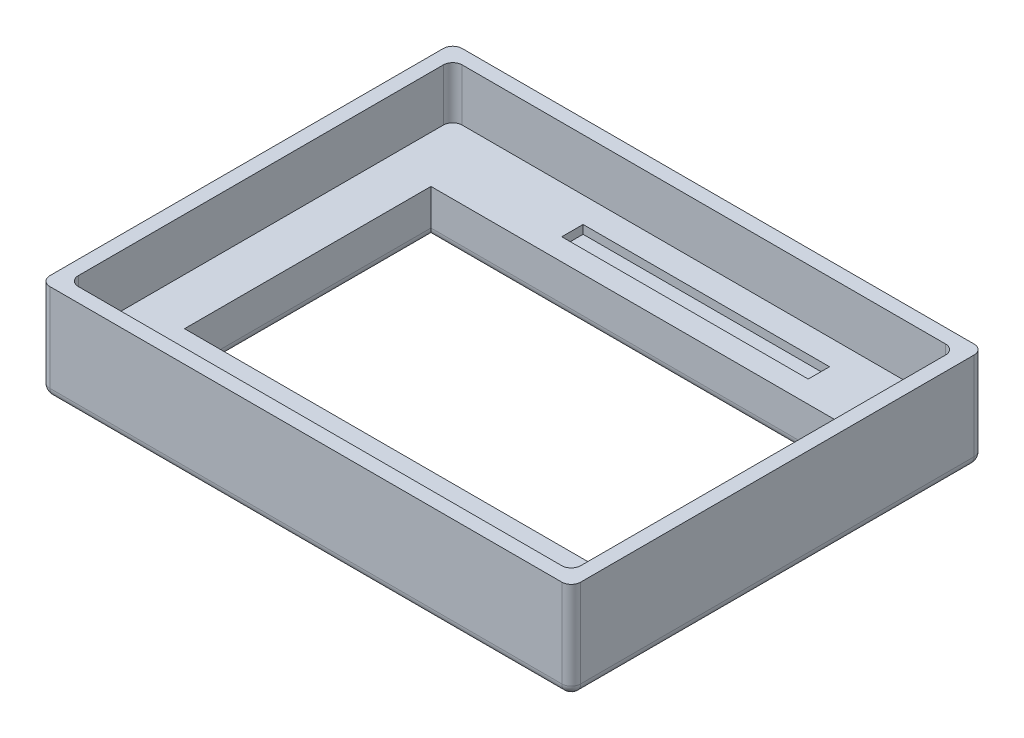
ISO-10303-21;
HEADER;
FILE_DESCRIPTION(('STEP AP214'),'2;1');
FILE_NAME('part.step','',(''),(''),'','','');
FILE_SCHEMA(('AUTOMOTIVE_DESIGN { 1 0 10303 214 1 1 1 1 }'));
ENDSEC;
DATA;
#1=APPLICATION_CONTEXT('core data for automotive mechanical design processes');
#2=APPLICATION_PROTOCOL_DEFINITION('international standard','automotive_design',2000,#1);
#3=PRODUCT_CONTEXT('',#1,'mechanical');
#4=PRODUCT('Part','Part','',(#3));
#5=PRODUCT_RELATED_PRODUCT_CATEGORY('part','',(#4));
#6=PRODUCT_DEFINITION_FORMATION('','',#4);
#7=PRODUCT_DEFINITION_CONTEXT('part definition',#1,'design');
#8=PRODUCT_DEFINITION('design','',#6,#7);
#9=PRODUCT_DEFINITION_SHAPE('','',#8);
#10=(LENGTH_UNIT() NAMED_UNIT(*) SI_UNIT(.MILLI.,.METRE.));
#11=(NAMED_UNIT(*) PLANE_ANGLE_UNIT() SI_UNIT($,.RADIAN.));
#12=(NAMED_UNIT(*) SI_UNIT($,.STERADIAN.) SOLID_ANGLE_UNIT());
#13=UNCERTAINTY_MEASURE_WITH_UNIT(LENGTH_MEASURE(1.E-05),#10,'distance_accuracy_value','');
#14=(GEOMETRIC_REPRESENTATION_CONTEXT(3) GLOBAL_UNCERTAINTY_ASSIGNED_CONTEXT((#13)) GLOBAL_UNIT_ASSIGNED_CONTEXT((#10,
#11,#12)) REPRESENTATION_CONTEXT('',''));
#15=CARTESIAN_POINT('',(0.,0.,0.));
#16=DIRECTION('',(0.,0.,1.));
#17=DIRECTION('',(1.,0.,0.));
#18=AXIS2_PLACEMENT_3D('',#15,#16,#17);
#19=CARTESIAN_POINT('',(0.,9.6,0.));
#20=DIRECTION('',(0.,1.,0.));
#21=DIRECTION('',(0.,0.,1.));
#22=AXIS2_PLACEMENT_3D('',#19,#20,#21);
#23=PLANE('',#22);
#24=DIRECTION('',(0.,0.,1.));
#25=VECTOR('',#24,1.);
#26=CARTESIAN_POINT('',(-14.3182788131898,9.6,-19.3381124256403));
#27=LINE('',#26,#25);
#28=CARTESIAN_POINT('',(-14.3182788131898,9.6,-19.3381124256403));
#29=VERTEX_POINT('',#28);
#30=CARTESIAN_POINT('',(-14.3182788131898,9.6,-14.8381124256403));
#31=VERTEX_POINT('',#30);
#32=EDGE_CURVE('E224',#29,#31,#27,.T.);
#33=ORIENTED_EDGE('',*,*,#32,.F.);
#34=DIRECTION('',(-1.,0.,0.));
#35=VECTOR('',#34,1.);
#36=CARTESIAN_POINT('',(-14.3182788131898,9.6,-19.3381124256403));
#37=LINE('',#36,#35);
#38=CARTESIAN_POINT('',(37.6817211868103,9.6,-19.3381124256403));
#39=VERTEX_POINT('',#38);
#40=EDGE_CURVE('E241',#39,#29,#37,.T.);
#41=ORIENTED_EDGE('',*,*,#40,.F.);
#42=DIRECTION('',(0.,0.,-1.));
#43=VECTOR('',#42,1.);
#44=CARTESIAN_POINT('',(37.6817211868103,9.6,-19.3381124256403));
#45=LINE('',#44,#43);
#46=CARTESIAN_POINT('',(37.6817211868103,9.6,-14.8381124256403));
#47=VERTEX_POINT('',#46);
#48=EDGE_CURVE('E244',#47,#39,#45,.T.);
#49=ORIENTED_EDGE('',*,*,#48,.F.);
#50=DIRECTION('',(1.,0.,0.));
#51=VECTOR('',#50,1.);
#52=CARTESIAN_POINT('',(-14.3182788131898,9.6,-14.8381124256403));
#53=LINE('',#52,#51);
#54=EDGE_CURVE('E253',#31,#47,#53,.T.);
#55=ORIENTED_EDGE('',*,*,#54,.F.);
#56=EDGE_LOOP('',(#33,#41,#49,#55));
#57=FACE_BOUND('',#56,.T.);
#58=DIRECTION('',(0.,0.,1.));
#59=VECTOR('',#58,1.);
#60=CARTESIAN_POINT('',(-37.3182788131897,9.6,-10.2381124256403));
#61=LINE('',#60,#59);
#62=CARTESIAN_POINT('',(-37.3182788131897,9.6,-10.2381124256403));
#63=VERTEX_POINT('',#62);
#64=CARTESIAN_POINT('',(-37.3182788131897,9.6,41.7618875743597));
#65=VERTEX_POINT('',#64);
#66=EDGE_CURVE('E259',#63,#65,#61,.T.);
#67=ORIENTED_EDGE('',*,*,#66,.F.);
#68=DIRECTION('',(-1.,0.,0.));
#69=VECTOR('',#68,1.);
#70=CARTESIAN_POINT('',(-37.3182788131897,9.6,-10.2381124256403));
#71=LINE('',#70,#69);
#72=CARTESIAN_POINT('',(48.7817211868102,9.6,-10.2381124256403));
#73=VERTEX_POINT('',#72);
#74=EDGE_CURVE('E271',#73,#63,#71,.T.);
#75=ORIENTED_EDGE('',*,*,#74,.F.);
#76=DIRECTION('',(0.,0.,-1.));
#77=VECTOR('',#76,1.);
#78=CARTESIAN_POINT('',(48.7817211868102,9.6,-10.2381124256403));
#79=LINE('',#78,#77);
#80=CARTESIAN_POINT('',(48.7817211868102,9.6,41.7618875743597));
#81=VERTEX_POINT('',#80);
#82=EDGE_CURVE('E268',#81,#73,#79,.T.);
#83=ORIENTED_EDGE('',*,*,#82,.F.);
#84=DIRECTION('',(1.,0.,0.));
#85=VECTOR('',#84,1.);
#86=CARTESIAN_POINT('',(-37.3182788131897,9.6,41.7618875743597));
#87=LINE('',#86,#85);
#88=EDGE_CURVE('E265',#65,#81,#87,.T.);
#89=ORIENTED_EDGE('',*,*,#88,.F.);
#90=EDGE_LOOP('',(#67,#75,#83,#89));
#91=FACE_BOUND('',#90,.T.);
#92=DIRECTION('',(-1.,0.,0.));
#93=VECTOR('',#92,1.);
#94=CARTESIAN_POINT('',(-47.2182788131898,9.6,-24.7381124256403));
#95=LINE('',#94,#93);
#96=CARTESIAN_POINT('',(56.7817211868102,9.6,-24.7381124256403));
#97=VERTEX_POINT('',#96);
#98=CARTESIAN_POINT('',(-45.2182788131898,9.6,-24.7381124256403));
#99=VERTEX_POINT('',#98);
#100=EDGE_CURVE('E305',#97,#99,#95,.T.);
#101=ORIENTED_EDGE('',*,*,#100,.T.);
#102=CARTESIAN_POINT('',(-45.2182788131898,9.6,-22.7381124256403));
#103=DIRECTION('',(0.,1.,0.));
#104=DIRECTION('',(0.,0.,1.));
#105=AXIS2_PLACEMENT_3D('',#102,#103,#104);
#106=CIRCLE('',#105,2.);
#107=CARTESIAN_POINT('',(-47.2182788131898,9.6,-22.7381124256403));
#108=VERTEX_POINT('',#107);
#109=EDGE_CURVE('E598',#99,#108,#106,.T.);
#110=ORIENTED_EDGE('',*,*,#109,.T.);
#111=DIRECTION('',(0.,0.,1.));
#112=VECTOR('',#111,1.);
#113=CARTESIAN_POINT('',(-47.2182788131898,9.6,-24.7381124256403));
#114=LINE('',#113,#112);
#115=CARTESIAN_POINT('',(-47.2182788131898,9.6,54.2618875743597));
#116=VERTEX_POINT('',#115);
#117=EDGE_CURVE('E277',#108,#116,#114,.T.);
#118=ORIENTED_EDGE('',*,*,#117,.T.);
#119=CARTESIAN_POINT('',(-45.2182788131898,9.6,54.2618875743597));
#120=DIRECTION('',(0.,1.,0.));
#121=DIRECTION('',(0.,0.,1.));
#122=AXIS2_PLACEMENT_3D('',#119,#120,#121);
#123=CIRCLE('',#122,2.);
#124=CARTESIAN_POINT('',(-45.2182788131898,9.6,56.2618875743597));
#125=VERTEX_POINT('',#124);
#126=EDGE_CURVE('E320',#116,#125,#123,.T.);
#127=ORIENTED_EDGE('',*,*,#126,.T.);
#128=DIRECTION('',(1.,0.,0.));
#129=VECTOR('',#128,1.);
#130=CARTESIAN_POINT('',(-47.2182788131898,9.6,56.2618875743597));
#131=LINE('',#130,#129);
#132=CARTESIAN_POINT('',(56.7817211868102,9.6,56.2618875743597));
#133=VERTEX_POINT('',#132);
#134=EDGE_CURVE('E291',#125,#133,#131,.T.);
#135=ORIENTED_EDGE('',*,*,#134,.T.);
#136=CARTESIAN_POINT('',(56.7817211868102,9.6,54.2618875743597));
#137=DIRECTION('',(0.,1.,0.));
#138=DIRECTION('',(0.,0.,1.));
#139=AXIS2_PLACEMENT_3D('',#136,#137,#138);
#140=CIRCLE('',#139,2.);
#141=CARTESIAN_POINT('',(58.7817211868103,9.6,54.2618875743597));
#142=VERTEX_POINT('',#141);
#143=EDGE_CURVE('E606',#133,#142,#140,.T.);
#144=ORIENTED_EDGE('',*,*,#143,.T.);
#145=DIRECTION('',(0.,0.,-1.));
#146=VECTOR('',#145,1.);
#147=CARTESIAN_POINT('',(58.7817211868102,9.6,-24.7381124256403));
#148=LINE('',#147,#146);
#149=CARTESIAN_POINT('',(58.7817211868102,9.6,-22.7381124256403));
#150=VERTEX_POINT('',#149);
#151=EDGE_CURVE('E296',#142,#150,#148,.T.);
#152=ORIENTED_EDGE('',*,*,#151,.T.);
#153=CARTESIAN_POINT('',(56.7817211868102,9.6,-22.7381124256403));
#154=DIRECTION('',(0.,1.,0.));
#155=DIRECTION('',(0.,0.,1.));
#156=AXIS2_PLACEMENT_3D('',#153,#154,#155);
#157=CIRCLE('',#156,2.);
#158=EDGE_CURVE('E600',#150,#97,#157,.T.);
#159=ORIENTED_EDGE('',*,*,#158,.T.);
#160=EDGE_LOOP('',(#101,#110,#118,#127,#135,#144,#152,#159));
#161=FACE_BOUND('',#160,.T.);
#162=ADVANCED_FACE('F32',(#57,#91,#161),#23,.T.);
#163=CARTESIAN_POINT('',(0.,0.,0.));
#164=DIRECTION('',(0.,1.,0.));
#165=DIRECTION('',(0.,0.,1.));
#166=AXIS2_PLACEMENT_3D('',#163,#164,#165);
#167=PLANE('',#166);
#168=DIRECTION('',(0.,0.,1.));
#169=VECTOR('',#168,1.);
#170=CARTESIAN_POINT('',(-48.2182788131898,0.,0.));
#171=LINE('',#170,#169);
#172=CARTESIAN_POINT('',(-48.2182788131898,0.,57.2618875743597));
#173=VERTEX_POINT('',#172);
#174=CARTESIAN_POINT('',(-48.2182788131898,0.,-25.7381124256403));
#175=VERTEX_POINT('',#174);
#176=EDGE_CURVE('E472',#173,#175,#171,.F.);
#177=ORIENTED_EDGE('',*,*,#176,.T.);
#178=DIRECTION('',(1.,0.,0.));
#179=VECTOR('',#178,1.);
#180=CARTESIAN_POINT('',(61.7817211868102,0.,-25.7381124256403));
#181=LINE('',#180,#179);
#182=CARTESIAN_POINT('',(59.7817211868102,0.,-25.7381124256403));
#183=VERTEX_POINT('',#182);
#184=EDGE_CURVE('E474',#175,#183,#181,.T.);
#185=ORIENTED_EDGE('',*,*,#184,.T.);
#186=DIRECTION('',(0.,0.,-1.));
#187=VECTOR('',#186,1.);
#188=CARTESIAN_POINT('',(59.7817211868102,0.,0.));
#189=LINE('',#188,#187);
#190=CARTESIAN_POINT('',(59.7817211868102,0.,57.2618875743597));
#191=VERTEX_POINT('',#190);
#192=EDGE_CURVE('E464',#183,#191,#189,.F.);
#193=ORIENTED_EDGE('',*,*,#192,.T.);
#194=DIRECTION('',(-1.,0.,0.));
#195=VECTOR('',#194,1.);
#196=CARTESIAN_POINT('',(-50.2182788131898,0.,57.2618875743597));
#197=LINE('',#196,#195);
#198=EDGE_CURVE('E466',#191,#173,#197,.T.);
#199=ORIENTED_EDGE('',*,*,#198,.T.);
#200=EDGE_LOOP('',(#177,#185,#193,#199));
#201=FACE_BOUND('',#200,.T.);
#202=DIRECTION('',(1.,0.,0.));
#203=VECTOR('',#202,1.);
#204=CARTESIAN_POINT('',(0.,0.,43.7618875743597));
#205=LINE('',#204,#203);
#206=CARTESIAN_POINT('',(-39.3182788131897,0.,43.7618875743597));
#207=VERTEX_POINT('',#206);
#208=CARTESIAN_POINT('',(50.7817211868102,0.,43.7618875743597));
#209=VERTEX_POINT('',#208);
#210=EDGE_CURVE('E383',#207,#209,#205,.T.);
#211=ORIENTED_EDGE('',*,*,#210,.T.);
#212=DIRECTION('',(0.,0.,-1.));
#213=VECTOR('',#212,1.);
#214=CARTESIAN_POINT('',(50.7817211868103,0.,0.));
#215=LINE('',#214,#213);
#216=CARTESIAN_POINT('',(50.7817211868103,0.,-12.2381124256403));
#217=VERTEX_POINT('',#216);
#218=EDGE_CURVE('E462',#209,#217,#215,.T.);
#219=ORIENTED_EDGE('',*,*,#218,.T.);
#220=DIRECTION('',(-1.,0.,0.));
#221=VECTOR('',#220,1.);
#222=CARTESIAN_POINT('',(0.,0.,-12.2381124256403));
#223=LINE('',#222,#221);
#224=CARTESIAN_POINT('',(-39.3182788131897,0.,-12.2381124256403));
#225=VERTEX_POINT('',#224);
#226=EDGE_CURVE('E308',#217,#225,#223,.T.);
#227=ORIENTED_EDGE('',*,*,#226,.T.);
#228=DIRECTION('',(0.,0.,1.));
#229=VECTOR('',#228,1.);
#230=CARTESIAN_POINT('',(-39.3182788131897,0.,0.));
#231=LINE('',#230,#229);
#232=EDGE_CURVE('E389',#225,#207,#231,.T.);
#233=ORIENTED_EDGE('',*,*,#232,.T.);
#234=EDGE_LOOP('',(#211,#219,#227,#233));
#235=FACE_BOUND('',#234,.T.);
#236=ADVANCED_FACE('F507',(#201,#235),#167,.F.);
#237=CARTESIAN_POINT('',(-37.3182788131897,0.,-10.2381124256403));
#238=DIRECTION('',(-1.,0.,0.));
#239=DIRECTION('',(0.,0.,1.));
#240=AXIS2_PLACEMENT_3D('',#237,#238,#239);
#241=PLANE('',#240);
#242=DIRECTION('',(0.,1.,0.));
#243=VECTOR('',#242,1.);
#244=CARTESIAN_POINT('',(-37.3182788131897,0.,41.7618875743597));
#245=LINE('',#244,#243);
#246=CARTESIAN_POINT('',(-37.3182788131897,2.,41.7618875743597));
#247=VERTEX_POINT('',#246);
#248=EDGE_CURVE('E274',#247,#65,#245,.T.);
#249=ORIENTED_EDGE('',*,*,#248,.F.);
#250=DIRECTION('',(0.,0.,1.));
#251=VECTOR('',#250,1.);
#252=CARTESIAN_POINT('',(-37.3182788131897,2.,-10.2381124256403));
#253=LINE('',#252,#251);
#254=CARTESIAN_POINT('',(-37.3182788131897,2.,-10.2381124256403));
#255=VERTEX_POINT('',#254);
#256=EDGE_CURVE('E390',#247,#255,#253,.F.);
#257=ORIENTED_EDGE('',*,*,#256,.T.);
#258=DIRECTION('',(0.,1.,0.));
#259=VECTOR('',#258,1.);
#260=CARTESIAN_POINT('',(-37.3182788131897,0.,-10.2381124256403));
#261=LINE('',#260,#259);
#262=EDGE_CURVE('E275',#255,#63,#261,.T.);
#263=ORIENTED_EDGE('',*,*,#262,.T.);
#264=ORIENTED_EDGE('',*,*,#66,.T.);
#265=EDGE_LOOP('',(#249,#257,#263,#264));
#266=FACE_BOUND('',#265,.T.);
#267=ADVANCED_FACE('F529',(#266),#241,.F.);
#268=CARTESIAN_POINT('',(-37.3182788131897,0.,-10.2381124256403));
#269=DIRECTION('',(0.,0.,-1.));
#270=DIRECTION('',(-1.,0.,0.));
#271=AXIS2_PLACEMENT_3D('',#268,#269,#270);
#272=PLANE('',#271);
#273=ORIENTED_EDGE('',*,*,#262,.F.);
#274=DIRECTION('',(-1.,0.,0.));
#275=VECTOR('',#274,1.);
#276=CARTESIAN_POINT('',(-37.3182788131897,2.,-10.2381124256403));
#277=LINE('',#276,#275);
#278=CARTESIAN_POINT('',(48.7817211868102,2.,-10.2381124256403));
#279=VERTEX_POINT('',#278);
#280=EDGE_CURVE('E395',#255,#279,#277,.F.);
#281=ORIENTED_EDGE('',*,*,#280,.T.);
#282=DIRECTION('',(0.,1.,0.));
#283=VECTOR('',#282,1.);
#284=CARTESIAN_POINT('',(48.7817211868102,0.,-10.2381124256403));
#285=LINE('',#284,#283);
#286=EDGE_CURVE('E278',#279,#73,#285,.T.);
#287=ORIENTED_EDGE('',*,*,#286,.T.);
#288=ORIENTED_EDGE('',*,*,#74,.T.);
#289=EDGE_LOOP('',(#273,#281,#287,#288));
#290=FACE_BOUND('',#289,.T.);
#291=ADVANCED_FACE('F455',(#290),#272,.F.);
#292=CARTESIAN_POINT('',(48.7817211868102,0.,-10.2381124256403));
#293=DIRECTION('',(1.,0.,0.));
#294=DIRECTION('',(0.,0.,-1.));
#295=AXIS2_PLACEMENT_3D('',#292,#293,#294);
#296=PLANE('',#295);
#297=ORIENTED_EDGE('',*,*,#286,.F.);
#298=DIRECTION('',(0.,0.,-1.));
#299=VECTOR('',#298,1.);
#300=CARTESIAN_POINT('',(48.7817211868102,2.,-10.2381124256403));
#301=LINE('',#300,#299);
#302=CARTESIAN_POINT('',(48.7817211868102,2.,41.7618875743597));
#303=VERTEX_POINT('',#302);
#304=EDGE_CURVE('E399',#279,#303,#301,.F.);
#305=ORIENTED_EDGE('',*,*,#304,.T.);
#306=DIRECTION('',(0.,1.,0.));
#307=VECTOR('',#306,1.);
#308=CARTESIAN_POINT('',(48.7817211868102,0.,41.7618875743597));
#309=LINE('',#308,#307);
#310=EDGE_CURVE('E280',#303,#81,#309,.T.);
#311=ORIENTED_EDGE('',*,*,#310,.T.);
#312=ORIENTED_EDGE('',*,*,#82,.T.);
#313=EDGE_LOOP('',(#297,#305,#311,#312));
#314=FACE_BOUND('',#313,.T.);
#315=ADVANCED_FACE('F443',(#314),#296,.F.);
#316=CARTESIAN_POINT('',(-37.3182788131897,0.,41.7618875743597));
#317=DIRECTION('',(0.,0.,1.));
#318=DIRECTION('',(1.,0.,0.));
#319=AXIS2_PLACEMENT_3D('',#316,#317,#318);
#320=PLANE('',#319);
#321=ORIENTED_EDGE('',*,*,#310,.F.);
#322=DIRECTION('',(1.,0.,0.));
#323=VECTOR('',#322,1.);
#324=CARTESIAN_POINT('',(-37.3182788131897,2.,41.7618875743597));
#325=LINE('',#324,#323);
#326=EDGE_CURVE('E381',#303,#247,#325,.F.);
#327=ORIENTED_EDGE('',*,*,#326,.T.);
#328=ORIENTED_EDGE('',*,*,#248,.T.);
#329=ORIENTED_EDGE('',*,*,#88,.T.);
#330=EDGE_LOOP('',(#321,#327,#328,#329));
#331=FACE_BOUND('',#330,.T.);
#332=ADVANCED_FACE('F447',(#331),#320,.F.);
#333=CARTESIAN_POINT('',(-14.3182788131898,7.8,-19.3381124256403));
#334=DIRECTION('',(-1.,0.,0.));
#335=DIRECTION('',(0.,0.,1.));
#336=AXIS2_PLACEMENT_3D('',#333,#334,#335);
#337=PLANE('',#336);
#338=ORIENTED_EDGE('',*,*,#32,.T.);
#339=DIRECTION('',(0.,1.,0.));
#340=VECTOR('',#339,1.);
#341=CARTESIAN_POINT('',(-14.3182788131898,7.8,-14.8381124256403));
#342=LINE('',#341,#340);
#343=CARTESIAN_POINT('',(-14.3182788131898,7.8,-14.8381124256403));
#344=VERTEX_POINT('',#343);
#345=EDGE_CURVE('E217',#344,#31,#342,.T.);
#346=ORIENTED_EDGE('',*,*,#345,.F.);
#347=DIRECTION('',(0.,0.,1.));
#348=VECTOR('',#347,1.);
#349=CARTESIAN_POINT('',(-14.3182788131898,7.8,-19.3381124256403));
#350=LINE('',#349,#348);
#351=CARTESIAN_POINT('',(-14.3182788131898,7.8,-19.3381124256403));
#352=VERTEX_POINT('',#351);
#353=EDGE_CURVE('E221',#352,#344,#350,.T.);
#354=ORIENTED_EDGE('',*,*,#353,.F.);
#355=DIRECTION('',(0.,1.,0.));
#356=VECTOR('',#355,1.);
#357=CARTESIAN_POINT('',(-14.3182788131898,7.8,-19.3381124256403));
#358=LINE('',#357,#356);
#359=EDGE_CURVE('E257',#352,#29,#358,.T.);
#360=ORIENTED_EDGE('',*,*,#359,.T.);
#361=EDGE_LOOP('',(#338,#346,#354,#360));
#362=FACE_BOUND('',#361,.T.);
#363=ADVANCED_FACE('F219',(#362),#337,.F.);
#364=CARTESIAN_POINT('',(-14.3182788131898,7.8,-19.3381124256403));
#365=DIRECTION('',(0.,0.,-1.));
#366=DIRECTION('',(-1.,0.,0.));
#367=AXIS2_PLACEMENT_3D('',#364,#365,#366);
#368=PLANE('',#367);
#369=ORIENTED_EDGE('',*,*,#40,.T.);
#370=ORIENTED_EDGE('',*,*,#359,.F.);
#371=DIRECTION('',(-1.,0.,0.));
#372=VECTOR('',#371,1.);
#373=CARTESIAN_POINT('',(-14.3182788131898,7.8,-19.3381124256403));
#374=LINE('',#373,#372);
#375=CARTESIAN_POINT('',(37.6817211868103,7.8,-19.3381124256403));
#376=VERTEX_POINT('',#375);
#377=EDGE_CURVE('E229',#376,#352,#374,.T.);
#378=ORIENTED_EDGE('',*,*,#377,.F.);
#379=DIRECTION('',(0.,1.,0.));
#380=VECTOR('',#379,1.);
#381=CARTESIAN_POINT('',(37.6817211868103,7.8,-19.3381124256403));
#382=LINE('',#381,#380);
#383=EDGE_CURVE('E260',#376,#39,#382,.T.);
#384=ORIENTED_EDGE('',*,*,#383,.T.);
#385=EDGE_LOOP('',(#369,#370,#378,#384));
#386=FACE_BOUND('',#385,.T.);
#387=ADVANCED_FACE('F621',(#386),#368,.F.);
#388=CARTESIAN_POINT('',(37.6817211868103,7.8,-19.3381124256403));
#389=DIRECTION('',(1.,0.,0.));
#390=DIRECTION('',(0.,0.,-1.));
#391=AXIS2_PLACEMENT_3D('',#388,#389,#390);
#392=PLANE('',#391);
#393=ORIENTED_EDGE('',*,*,#48,.T.);
#394=ORIENTED_EDGE('',*,*,#383,.F.);
#395=DIRECTION('',(0.,0.,-1.));
#396=VECTOR('',#395,1.);
#397=CARTESIAN_POINT('',(37.6817211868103,7.8,-19.3381124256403));
#398=LINE('',#397,#396);
#399=CARTESIAN_POINT('',(37.6817211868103,7.8,-14.8381124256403));
#400=VERTEX_POINT('',#399);
#401=EDGE_CURVE('E237',#400,#376,#398,.T.);
#402=ORIENTED_EDGE('',*,*,#401,.F.);
#403=DIRECTION('',(0.,1.,0.));
#404=VECTOR('',#403,1.);
#405=CARTESIAN_POINT('',(37.6817211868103,7.8,-14.8381124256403));
#406=LINE('',#405,#404);
#407=EDGE_CURVE('E228',#400,#47,#406,.T.);
#408=ORIENTED_EDGE('',*,*,#407,.T.);
#409=EDGE_LOOP('',(#393,#394,#402,#408));
#410=FACE_BOUND('',#409,.T.);
#411=ADVANCED_FACE('F624',(#410),#392,.F.);
#412=CARTESIAN_POINT('',(-14.3182788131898,7.8,-14.8381124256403));
#413=DIRECTION('',(0.,0.,1.));
#414=DIRECTION('',(1.,0.,0.));
#415=AXIS2_PLACEMENT_3D('',#412,#413,#414);
#416=PLANE('',#415);
#417=ORIENTED_EDGE('',*,*,#54,.T.);
#418=ORIENTED_EDGE('',*,*,#407,.F.);
#419=DIRECTION('',(1.,0.,0.));
#420=VECTOR('',#419,1.);
#421=CARTESIAN_POINT('',(-14.3182788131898,7.8,-14.8381124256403));
#422=LINE('',#421,#420);
#423=EDGE_CURVE('E232',#344,#400,#422,.T.);
#424=ORIENTED_EDGE('',*,*,#423,.F.);
#425=ORIENTED_EDGE('',*,*,#345,.T.);
#426=EDGE_LOOP('',(#417,#418,#424,#425));
#427=FACE_BOUND('',#426,.T.);
#428=ADVANCED_FACE('F233',(#427),#416,.F.);
#429=CARTESIAN_POINT('',(0.,7.8,0.));
#430=DIRECTION('',(0.,1.,0.));
#431=DIRECTION('',(0.,0.,1.));
#432=AXIS2_PLACEMENT_3D('',#429,#430,#431);
#433=PLANE('',#432);
#434=ORIENTED_EDGE('',*,*,#353,.T.);
#435=ORIENTED_EDGE('',*,*,#423,.T.);
#436=ORIENTED_EDGE('',*,*,#401,.T.);
#437=ORIENTED_EDGE('',*,*,#377,.T.);
#438=EDGE_LOOP('',(#434,#435,#436,#437));
#439=FACE_BOUND('',#438,.T.);
#440=ADVANCED_FACE('F239',(#439),#433,.T.);
#441=CARTESIAN_POINT('',(-47.2182788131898,20.6,-24.7381124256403));
#442=DIRECTION('',(-1.,0.,0.));
#443=DIRECTION('',(0.,0.,1.));
#444=AXIS2_PLACEMENT_3D('',#441,#442,#443);
#445=PLANE('',#444);
#446=ORIENTED_EDGE('',*,*,#117,.F.);
#447=DIRECTION('',(0.,-1.,0.));
#448=VECTOR('',#447,1.);
#449=CARTESIAN_POINT('',(-47.2182788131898,20.6,-22.7381124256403));
#450=LINE('',#449,#448);
#451=CARTESIAN_POINT('',(-47.2182788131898,20.6,-22.7381124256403));
#452=VERTEX_POINT('',#451);
#453=EDGE_CURVE('E587',#108,#452,#450,.F.);
#454=ORIENTED_EDGE('',*,*,#453,.T.);
#455=DIRECTION('',(0.,0.,-1.));
#456=VECTOR('',#455,1.);
#457=CARTESIAN_POINT('',(-47.2182788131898,20.6,-24.7381124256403));
#458=LINE('',#457,#456);
#459=CARTESIAN_POINT('',(-47.2182788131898,20.6,54.2618875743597));
#460=VERTEX_POINT('',#459);
#461=EDGE_CURVE('E420',#460,#452,#458,.T.);
#462=ORIENTED_EDGE('',*,*,#461,.F.);
#463=DIRECTION('',(0.,-1.,0.));
#464=VECTOR('',#463,1.);
#465=CARTESIAN_POINT('',(-47.2182788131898,20.6,54.2618875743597));
#466=LINE('',#465,#464);
#467=EDGE_CURVE('E592',#460,#116,#466,.T.);
#468=ORIENTED_EDGE('',*,*,#467,.T.);
#469=EDGE_LOOP('',(#446,#454,#462,#468));
#470=FACE_BOUND('',#469,.T.);
#471=ADVANCED_FACE('F610',(#470),#445,.F.);
#472=CARTESIAN_POINT('',(-50.2182788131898,20.6,-24.7381124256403));
#473=DIRECTION('',(1.,0.,0.));
#474=DIRECTION('',(0.,0.,-1.));
#475=AXIS2_PLACEMENT_3D('',#472,#473,#474);
#476=PLANE('',#475);
#477=DIRECTION('',(0.,0.,1.));
#478=VECTOR('',#477,1.);
#479=CARTESIAN_POINT('',(-50.2182788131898,20.6,-24.7381124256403));
#480=LINE('',#479,#478);
#481=CARTESIAN_POINT('',(-50.2182788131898,20.6,-25.7381124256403));
#482=VERTEX_POINT('',#481);
#483=CARTESIAN_POINT('',(-50.2182788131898,20.6,57.2618875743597));
#484=VERTEX_POINT('',#483);
#485=EDGE_CURVE('E247',#482,#484,#480,.T.);
#486=ORIENTED_EDGE('',*,*,#485,.F.);
#487=DIRECTION('',(0.,-1.,0.));
#488=VECTOR('',#487,1.);
#489=CARTESIAN_POINT('',(-50.2182788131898,0.,-25.7381124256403));
#490=LINE('',#489,#488);
#491=CARTESIAN_POINT('',(-50.2182788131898,2.,-25.7381124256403));
#492=VERTEX_POINT('',#491);
#493=EDGE_CURVE('E416',#482,#492,#490,.T.);
#494=ORIENTED_EDGE('',*,*,#493,.T.);
#495=DIRECTION('',(0.,0.,1.));
#496=VECTOR('',#495,1.);
#497=CARTESIAN_POINT('',(-50.2182788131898,2.,-24.7381124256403));
#498=LINE('',#497,#496);
#499=CARTESIAN_POINT('',(-50.2182788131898,2.,57.2618875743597));
#500=VERTEX_POINT('',#499);
#501=EDGE_CURVE('E424',#492,#500,#498,.T.);
#502=ORIENTED_EDGE('',*,*,#501,.T.);
#503=DIRECTION('',(0.,-1.,0.));
#504=VECTOR('',#503,1.);
#505=CARTESIAN_POINT('',(-50.2182788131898,20.6,57.2618875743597));
#506=LINE('',#505,#504);
#507=EDGE_CURVE('E419',#500,#484,#506,.F.);
#508=ORIENTED_EDGE('',*,*,#507,.T.);
#509=EDGE_LOOP('',(#486,#494,#502,#508));
#510=FACE_BOUND('',#509,.T.);
#511=ADVANCED_FACE('F415',(#510),#476,.F.);
#512=CARTESIAN_POINT('',(0.,20.6,0.));
#513=DIRECTION('',(0.,-1.,0.));
#514=DIRECTION('',(0.,0.,-1.));
#515=AXIS2_PLACEMENT_3D('',#512,#513,#514);
#516=PLANE('',#515);
#517=DIRECTION('',(-1.,0.,0.));
#518=VECTOR('',#517,1.);
#519=CARTESIAN_POINT('',(61.7817211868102,20.6,59.2618875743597));
#520=LINE('',#519,#518);
#521=CARTESIAN_POINT('',(59.7817211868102,20.6,59.2618875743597));
#522=VERTEX_POINT('',#521);
#523=CARTESIAN_POINT('',(-48.2182788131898,20.6,59.2618875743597));
#524=VERTEX_POINT('',#523);
#525=EDGE_CURVE('E367',#522,#524,#520,.T.);
#526=ORIENTED_EDGE('',*,*,#525,.F.);
#527=CARTESIAN_POINT('',(59.7817211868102,20.6,57.2618875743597));
#528=DIRECTION('',(0.,-1.,0.));
#529=DIRECTION('',(0.,0.,-1.));
#530=AXIS2_PLACEMENT_3D('',#527,#528,#529);
#531=CIRCLE('',#530,2.);
#532=CARTESIAN_POINT('',(61.7817211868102,20.6,57.2618875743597));
#533=VERTEX_POINT('',#532);
#534=EDGE_CURVE('E313',#522,#533,#531,.F.);
#535=ORIENTED_EDGE('',*,*,#534,.T.);
#536=DIRECTION('',(0.,0.,-1.));
#537=VECTOR('',#536,1.);
#538=CARTESIAN_POINT('',(61.7817211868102,20.6,-24.7381124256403));
#539=LINE('',#538,#537);
#540=CARTESIAN_POINT('',(61.7817211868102,20.6,-25.7381124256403));
#541=VERTEX_POINT('',#540);
#542=EDGE_CURVE('E581',#533,#541,#539,.T.);
#543=ORIENTED_EDGE('',*,*,#542,.T.);
#544=CARTESIAN_POINT('',(59.7817211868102,20.6,-25.7381124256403));
#545=DIRECTION('',(0.,-1.,0.));
#546=DIRECTION('',(0.,0.,-1.));
#547=AXIS2_PLACEMENT_3D('',#544,#545,#546);
#548=CIRCLE('',#547,2.);
#549=CARTESIAN_POINT('',(59.7817211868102,20.6,-27.7381124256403));
#550=VERTEX_POINT('',#549);
#551=EDGE_CURVE('E321',#541,#550,#548,.F.);
#552=ORIENTED_EDGE('',*,*,#551,.T.);
#553=DIRECTION('',(1.,0.,0.));
#554=VECTOR('',#553,1.);
#555=CARTESIAN_POINT('',(61.7817211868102,20.6,-27.7381124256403));
#556=LINE('',#555,#554);
#557=CARTESIAN_POINT('',(-48.2182788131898,20.6,-27.7381124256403));
#558=VERTEX_POINT('',#557);
#559=EDGE_CURVE('E410',#558,#550,#556,.T.);
#560=ORIENTED_EDGE('',*,*,#559,.F.);
#561=CARTESIAN_POINT('',(-48.2182788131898,20.6,-25.7381124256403));
#562=DIRECTION('',(0.,-1.,0.));
#563=DIRECTION('',(0.,0.,-1.));
#564=AXIS2_PLACEMENT_3D('',#561,#562,#563);
#565=CIRCLE('',#564,2.);
#566=EDGE_CURVE('E328',#558,#482,#565,.F.);
#567=ORIENTED_EDGE('',*,*,#566,.T.);
#568=ORIENTED_EDGE('',*,*,#485,.T.);
#569=CARTESIAN_POINT('',(-48.2182788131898,20.6,57.2618875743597));
#570=DIRECTION('',(0.,-1.,0.));
#571=DIRECTION('',(0.,0.,-1.));
#572=AXIS2_PLACEMENT_3D('',#569,#570,#571);
#573=CIRCLE('',#572,2.);
#574=EDGE_CURVE('E397',#484,#524,#573,.F.);
#575=ORIENTED_EDGE('',*,*,#574,.T.);
#576=EDGE_LOOP('',(#526,#535,#543,#552,#560,#567,#568,#575));
#577=FACE_BOUND('',#576,.T.);
#578=DIRECTION('',(1.,0.,0.));
#579=VECTOR('',#578,1.);
#580=CARTESIAN_POINT('',(61.7817211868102,20.6,56.2618875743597));
#581=LINE('',#580,#579);
#582=CARTESIAN_POINT('',(-45.2182788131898,20.6,56.2618875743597));
#583=VERTEX_POINT('',#582);
#584=CARTESIAN_POINT('',(56.7817211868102,20.6,56.2618875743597));
#585=VERTEX_POINT('',#584);
#586=EDGE_CURVE('E572',#583,#585,#581,.T.);
#587=ORIENTED_EDGE('',*,*,#586,.F.);
#588=CARTESIAN_POINT('',(-45.2182788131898,20.6,54.2618875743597));
#589=DIRECTION('',(0.,-1.,0.));
#590=DIRECTION('',(0.,0.,-1.));
#591=AXIS2_PLACEMENT_3D('',#588,#589,#590);
#592=CIRCLE('',#591,2.);
#593=EDGE_CURVE('E11',#583,#460,#592,.T.);
#594=ORIENTED_EDGE('',*,*,#593,.T.);
#595=ORIENTED_EDGE('',*,*,#461,.T.);
#596=CARTESIAN_POINT('',(-45.2182788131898,20.6,-22.7381124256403));
#597=DIRECTION('',(0.,-1.,0.));
#598=DIRECTION('',(0.,0.,-1.));
#599=AXIS2_PLACEMENT_3D('',#596,#597,#598);
#600=CIRCLE('',#599,2.);
#601=CARTESIAN_POINT('',(-45.2182788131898,20.6,-24.7381124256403));
#602=VERTEX_POINT('',#601);
#603=EDGE_CURVE('E565',#452,#602,#600,.T.);
#604=ORIENTED_EDGE('',*,*,#603,.T.);
#605=DIRECTION('',(-1.,0.,0.));
#606=VECTOR('',#605,1.);
#607=CARTESIAN_POINT('',(61.7817211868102,20.6,-24.7381124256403));
#608=LINE('',#607,#606);
#609=CARTESIAN_POINT('',(56.7817211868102,20.6,-24.7381124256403));
#610=VERTEX_POINT('',#609);
#611=EDGE_CURVE('E309',#610,#602,#608,.T.);
#612=ORIENTED_EDGE('',*,*,#611,.F.);
#613=CARTESIAN_POINT('',(56.7817211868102,20.6,-22.7381124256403));
#614=DIRECTION('',(0.,-1.,0.));
#615=DIRECTION('',(0.,0.,-1.));
#616=AXIS2_PLACEMENT_3D('',#613,#614,#615);
#617=CIRCLE('',#616,2.);
#618=CARTESIAN_POINT('',(58.7817211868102,20.6,-22.7381124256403));
#619=VERTEX_POINT('',#618);
#620=EDGE_CURVE('E564',#610,#619,#617,.T.);
#621=ORIENTED_EDGE('',*,*,#620,.T.);
#622=DIRECTION('',(0.,0.,1.));
#623=VECTOR('',#622,1.);
#624=CARTESIAN_POINT('',(58.7817211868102,20.6,-24.7381124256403));
#625=LINE('',#624,#623);
#626=CARTESIAN_POINT('',(58.7817211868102,20.6,54.2618875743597));
#627=VERTEX_POINT('',#626);
#628=EDGE_CURVE('E580',#619,#627,#625,.T.);
#629=ORIENTED_EDGE('',*,*,#628,.T.);
#630=CARTESIAN_POINT('',(56.7817211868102,20.6,54.2618875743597));
#631=DIRECTION('',(0.,-1.,0.));
#632=DIRECTION('',(0.,0.,-1.));
#633=AXIS2_PLACEMENT_3D('',#630,#631,#632);
#634=CIRCLE('',#633,2.);
#635=EDGE_CURVE('E40',#627,#585,#634,.T.);
#636=ORIENTED_EDGE('',*,*,#635,.T.);
#637=EDGE_LOOP('',(#587,#594,#595,#604,#612,#621,#629,#636));
#638=FACE_BOUND('',#637,.T.);
#639=ADVANCED_FACE('F407',(#577,#638),#516,.F.);
#640=CARTESIAN_POINT('',(58.7817211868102,20.6,-24.7381124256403));
#641=DIRECTION('',(1.,0.,0.));
#642=DIRECTION('',(0.,0.,-1.));
#643=AXIS2_PLACEMENT_3D('',#640,#641,#642);
#644=PLANE('',#643);
#645=ORIENTED_EDGE('',*,*,#628,.F.);
#646=DIRECTION('',(0.,-1.,0.));
#647=VECTOR('',#646,1.);
#648=CARTESIAN_POINT('',(58.7817211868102,20.6,-22.7381124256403));
#649=LINE('',#648,#647);
#650=EDGE_CURVE('E571',#619,#150,#649,.T.);
#651=ORIENTED_EDGE('',*,*,#650,.T.);
#652=ORIENTED_EDGE('',*,*,#151,.F.);
#653=DIRECTION('',(0.,-1.,0.));
#654=VECTOR('',#653,1.);
#655=CARTESIAN_POINT('',(58.7817211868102,20.6,54.2618875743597));
#656=LINE('',#655,#654);
#657=EDGE_CURVE('E561',#142,#627,#656,.F.);
#658=ORIENTED_EDGE('',*,*,#657,.T.);
#659=EDGE_LOOP('',(#645,#651,#652,#658));
#660=FACE_BOUND('',#659,.T.);
#661=ADVANCED_FACE('F727',(#660),#644,.F.);
#662=CARTESIAN_POINT('',(61.7817211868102,20.6,-24.7381124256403));
#663=DIRECTION('',(-1.,0.,0.));
#664=DIRECTION('',(0.,0.,1.));
#665=AXIS2_PLACEMENT_3D('',#662,#663,#664);
#666=PLANE('',#665);
#667=ORIENTED_EDGE('',*,*,#542,.F.);
#668=DIRECTION('',(0.,-1.,0.));
#669=VECTOR('',#668,1.);
#670=CARTESIAN_POINT('',(61.7817211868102,0.,57.2618875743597));
#671=LINE('',#670,#669);
#672=CARTESIAN_POINT('',(61.7817211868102,2.,57.2618875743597));
#673=VERTEX_POINT('',#672);
#674=EDGE_CURVE('E438',#533,#673,#671,.T.);
#675=ORIENTED_EDGE('',*,*,#674,.T.);
#676=DIRECTION('',(0.,0.,-1.));
#677=VECTOR('',#676,1.);
#678=CARTESIAN_POINT('',(61.7817211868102,2.,-24.7381124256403));
#679=LINE('',#678,#677);
#680=CARTESIAN_POINT('',(61.7817211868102,2.,-25.7381124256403));
#681=VERTEX_POINT('',#680);
#682=EDGE_CURVE('E436',#673,#681,#679,.T.);
#683=ORIENTED_EDGE('',*,*,#682,.T.);
#684=DIRECTION('',(0.,-1.,0.));
#685=VECTOR('',#684,1.);
#686=CARTESIAN_POINT('',(61.7817211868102,20.6,-25.7381124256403));
#687=LINE('',#686,#685);
#688=EDGE_CURVE('E434',#681,#541,#687,.F.);
#689=ORIENTED_EDGE('',*,*,#688,.T.);
#690=EDGE_LOOP('',(#667,#675,#683,#689));
#691=FACE_BOUND('',#690,.T.);
#692=ADVANCED_FACE('F737',(#691),#666,.F.);
#693=CARTESIAN_POINT('',(61.7817211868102,20.6,-27.7381124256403));
#694=DIRECTION('',(0.,0.,-1.));
#695=DIRECTION('',(-1.,0.,0.));
#696=AXIS2_PLACEMENT_3D('',#693,#694,#695);
#697=PLANE('',#696);
#698=ORIENTED_EDGE('',*,*,#559,.T.);
#699=DIRECTION('',(0.,-1.,0.));
#700=VECTOR('',#699,1.);
#701=CARTESIAN_POINT('',(59.7817211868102,0.,-27.7381124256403));
#702=LINE('',#701,#700);
#703=CARTESIAN_POINT('',(59.7817211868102,2.,-27.7381124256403));
#704=VERTEX_POINT('',#703);
#705=EDGE_CURVE('E482',#550,#704,#702,.T.);
#706=ORIENTED_EDGE('',*,*,#705,.T.);
#707=DIRECTION('',(1.,0.,0.));
#708=VECTOR('',#707,1.);
#709=CARTESIAN_POINT('',(-50.2182788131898,2.,-27.7381124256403));
#710=LINE('',#709,#708);
#711=CARTESIAN_POINT('',(-48.2182788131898,2.,-27.7381124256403));
#712=VERTEX_POINT('',#711);
#713=EDGE_CURVE('E479',#704,#712,#710,.F.);
#714=ORIENTED_EDGE('',*,*,#713,.T.);
#715=DIRECTION('',(0.,-1.,0.));
#716=VECTOR('',#715,1.);
#717=CARTESIAN_POINT('',(-48.2182788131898,20.6,-27.7381124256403));
#718=LINE('',#717,#716);
#719=EDGE_CURVE('E477',#712,#558,#718,.F.);
#720=ORIENTED_EDGE('',*,*,#719,.T.);
#721=EDGE_LOOP('',(#698,#706,#714,#720));
#722=FACE_BOUND('',#721,.T.);
#723=ADVANCED_FACE('F486',(#722),#697,.T.);
#724=CARTESIAN_POINT('',(61.7817211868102,20.6,-24.7381124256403));
#725=DIRECTION('',(0.,0.,1.));
#726=DIRECTION('',(1.,0.,0.));
#727=AXIS2_PLACEMENT_3D('',#724,#725,#726);
#728=PLANE('',#727);
#729=ORIENTED_EDGE('',*,*,#611,.T.);
#730=DIRECTION('',(0.,-1.,0.));
#731=VECTOR('',#730,1.);
#732=CARTESIAN_POINT('',(-45.2182788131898,20.6,-24.7381124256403));
#733=LINE('',#732,#731);
#734=EDGE_CURVE('E292',#602,#99,#733,.T.);
#735=ORIENTED_EDGE('',*,*,#734,.T.);
#736=ORIENTED_EDGE('',*,*,#100,.F.);
#737=DIRECTION('',(0.,-1.,0.));
#738=VECTOR('',#737,1.);
#739=CARTESIAN_POINT('',(56.7817211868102,20.6,-24.7381124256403));
#740=LINE('',#739,#738);
#741=EDGE_CURVE('E312',#97,#610,#740,.F.);
#742=ORIENTED_EDGE('',*,*,#741,.T.);
#743=EDGE_LOOP('',(#729,#735,#736,#742));
#744=FACE_BOUND('',#743,.T.);
#745=ADVANCED_FACE('F745',(#744),#728,.T.);
#746=CARTESIAN_POINT('',(61.7817211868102,20.6,56.2618875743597));
#747=DIRECTION('',(0.,0.,-1.));
#748=DIRECTION('',(-1.,0.,0.));
#749=AXIS2_PLACEMENT_3D('',#746,#747,#748);
#750=PLANE('',#749);
#751=ORIENTED_EDGE('',*,*,#586,.T.);
#752=DIRECTION('',(0.,-1.,0.));
#753=VECTOR('',#752,1.);
#754=CARTESIAN_POINT('',(56.7817211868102,20.6,56.2618875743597));
#755=LINE('',#754,#753);
#756=EDGE_CURVE('E563',#585,#133,#755,.T.);
#757=ORIENTED_EDGE('',*,*,#756,.T.);
#758=ORIENTED_EDGE('',*,*,#134,.F.);
#759=DIRECTION('',(0.,-1.,0.));
#760=VECTOR('',#759,1.);
#761=CARTESIAN_POINT('',(-45.2182788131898,20.6,56.2618875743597));
#762=LINE('',#761,#760);
#763=EDGE_CURVE('E53',#125,#583,#762,.F.);
#764=ORIENTED_EDGE('',*,*,#763,.T.);
#765=EDGE_LOOP('',(#751,#757,#758,#764));
#766=FACE_BOUND('',#765,.T.);
#767=ADVANCED_FACE('F607',(#766),#750,.T.);
#768=CARTESIAN_POINT('',(61.7817211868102,20.6,59.2618875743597));
#769=DIRECTION('',(0.,0.,1.));
#770=DIRECTION('',(1.,0.,0.));
#771=AXIS2_PLACEMENT_3D('',#768,#769,#770);
#772=PLANE('',#771);
#773=DIRECTION('',(-1.,0.,0.));
#774=VECTOR('',#773,1.);
#775=CARTESIAN_POINT('',(61.7817211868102,2.,59.2618875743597));
#776=LINE('',#775,#774);
#777=CARTESIAN_POINT('',(-48.2182788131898,2.,59.2618875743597));
#778=VERTEX_POINT('',#777);
#779=CARTESIAN_POINT('',(59.7817211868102,2.,59.2618875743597));
#780=VERTEX_POINT('',#779);
#781=EDGE_CURVE('E426',#778,#780,#776,.F.);
#782=ORIENTED_EDGE('',*,*,#781,.T.);
#783=DIRECTION('',(0.,-1.,0.));
#784=VECTOR('',#783,1.);
#785=CARTESIAN_POINT('',(59.7817211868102,20.6,59.2618875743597));
#786=LINE('',#785,#784);
#787=EDGE_CURVE('E432',#780,#522,#786,.F.);
#788=ORIENTED_EDGE('',*,*,#787,.T.);
#789=ORIENTED_EDGE('',*,*,#525,.T.);
#790=DIRECTION('',(0.,-1.,0.));
#791=VECTOR('',#790,1.);
#792=CARTESIAN_POINT('',(-48.2182788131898,0.,59.2618875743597));
#793=LINE('',#792,#791);
#794=EDGE_CURVE('E423',#524,#778,#793,.T.);
#795=ORIENTED_EDGE('',*,*,#794,.T.);
#796=EDGE_LOOP('',(#782,#788,#789,#795));
#797=FACE_BOUND('',#796,.T.);
#798=ADVANCED_FACE('F760',(#797),#772,.T.);
#799=CARTESIAN_POINT('',(-48.2182788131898,20.6,57.2618875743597));
#800=DIRECTION('',(0.,1.,0.));
#801=DIRECTION('',(0.,0.,1.));
#802=AXIS2_PLACEMENT_3D('',#799,#800,#801);
#803=CYLINDRICAL_SURFACE('',#802,2.);
#804=ORIENTED_EDGE('',*,*,#574,.F.);
#805=ORIENTED_EDGE('',*,*,#507,.F.);
#806=CARTESIAN_POINT('',(-48.2182788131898,2.,57.2618875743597));
#807=DIRECTION('',(0.,-1.,0.));
#808=DIRECTION('',(1.,0.,0.));
#809=AXIS2_PLACEMENT_3D('',#806,#807,#808);
#810=CIRCLE('',#809,2.);
#811=EDGE_CURVE('E364',#778,#500,#810,.T.);
#812=ORIENTED_EDGE('',*,*,#811,.F.);
#813=ORIENTED_EDGE('',*,*,#794,.F.);
#814=EDGE_LOOP('',(#804,#805,#812,#813));
#815=FACE_BOUND('',#814,.T.);
#816=ADVANCED_FACE('F884',(#815),#803,.T.);
#817=CARTESIAN_POINT('',(0.,2.,57.2618875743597));
#818=DIRECTION('',(1.,0.,0.));
#819=DIRECTION('',(0.,0.,-1.));
#820=AXIS2_PLACEMENT_3D('',#817,#818,#819);
#821=CYLINDRICAL_SURFACE('',#820,2.);
#822=CARTESIAN_POINT('',(59.7817211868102,2.,57.2618875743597));
#823=DIRECTION('',(1.,0.,0.));
#824=DIRECTION('',(0.,0.,-1.));
#825=AXIS2_PLACEMENT_3D('',#822,#823,#824);
#826=CIRCLE('',#825,2.);
#827=EDGE_CURVE('E358',#780,#191,#826,.T.);
#828=ORIENTED_EDGE('',*,*,#827,.F.);
#829=ORIENTED_EDGE('',*,*,#781,.F.);
#830=CARTESIAN_POINT('',(-48.2182788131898,2.,57.2618875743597));
#831=DIRECTION('',(-1.,0.,0.));
#832=DIRECTION('',(0.,0.,1.));
#833=AXIS2_PLACEMENT_3D('',#830,#831,#832);
#834=CIRCLE('',#833,2.);
#835=EDGE_CURVE('E361',#173,#778,#834,.T.);
#836=ORIENTED_EDGE('',*,*,#835,.F.);
#837=ORIENTED_EDGE('',*,*,#198,.F.);
#838=EDGE_LOOP('',(#828,#829,#836,#837));
#839=FACE_BOUND('',#838,.T.);
#840=ADVANCED_FACE('F874',(#839),#821,.T.);
#841=CARTESIAN_POINT('',(59.7817211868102,20.6,57.2618875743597));
#842=DIRECTION('',(0.,1.,0.));
#843=DIRECTION('',(0.,0.,1.));
#844=AXIS2_PLACEMENT_3D('',#841,#842,#843);
#845=CYLINDRICAL_SURFACE('',#844,2.);
#846=ORIENTED_EDGE('',*,*,#534,.F.);
#847=ORIENTED_EDGE('',*,*,#787,.F.);
#848=CARTESIAN_POINT('',(59.7817211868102,2.,57.2618875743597));
#849=DIRECTION('',(0.,-1.,0.));
#850=DIRECTION('',(0.,0.,-1.));
#851=AXIS2_PLACEMENT_3D('',#848,#849,#850);
#852=CIRCLE('',#851,2.);
#853=EDGE_CURVE('E355',#673,#780,#852,.T.);
#854=ORIENTED_EDGE('',*,*,#853,.F.);
#855=ORIENTED_EDGE('',*,*,#674,.F.);
#856=EDGE_LOOP('',(#846,#847,#854,#855));
#857=FACE_BOUND('',#856,.T.);
#858=ADVANCED_FACE('F864',(#857),#845,.T.);
#859=CARTESIAN_POINT('',(-48.2182788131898,2.,57.2618875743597));
#860=DIRECTION('',(0.,0.,1.));
#861=DIRECTION('',(1.,0.,0.));
#862=AXIS2_PLACEMENT_3D('',#859,#860,#861);
#863=SPHERICAL_SURFACE('',#862,2.);
#864=ORIENTED_EDGE('',*,*,#835,.T.);
#865=ORIENTED_EDGE('',*,*,#811,.T.);
#866=CARTESIAN_POINT('',(-48.2182788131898,2.,57.2618875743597));
#867=DIRECTION('',(0.,0.,1.));
#868=DIRECTION('',(1.,0.,0.));
#869=AXIS2_PLACEMENT_3D('',#866,#867,#868);
#870=CIRCLE('',#869,2.);
#871=EDGE_CURVE('E352',#173,#500,#870,.F.);
#872=ORIENTED_EDGE('',*,*,#871,.F.);
#873=EDGE_LOOP('',(#864,#865,#872));
#874=FACE_BOUND('',#873,.T.);
#875=ADVANCED_FACE('F854',(#874),#863,.T.);
#876=CARTESIAN_POINT('',(59.7817211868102,2.,57.2618875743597));
#877=DIRECTION('',(0.,0.,1.));
#878=DIRECTION('',(1.,0.,0.));
#879=AXIS2_PLACEMENT_3D('',#876,#877,#878);
#880=SPHERICAL_SURFACE('',#879,2.);
#881=ORIENTED_EDGE('',*,*,#853,.T.);
#882=ORIENTED_EDGE('',*,*,#827,.T.);
#883=CARTESIAN_POINT('',(59.7817211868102,2.,57.2618875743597));
#884=DIRECTION('',(0.,0.,1.));
#885=DIRECTION('',(1.,0.,0.));
#886=AXIS2_PLACEMENT_3D('',#883,#884,#885);
#887=CIRCLE('',#886,2.);
#888=EDGE_CURVE('E349',#673,#191,#887,.F.);
#889=ORIENTED_EDGE('',*,*,#888,.F.);
#890=EDGE_LOOP('',(#881,#882,#889));
#891=FACE_BOUND('',#890,.T.);
#892=ADVANCED_FACE('F845',(#891),#880,.T.);
#893=CARTESIAN_POINT('',(-48.2182788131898,20.6,-25.7381124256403));
#894=DIRECTION('',(0.,1.,0.));
#895=DIRECTION('',(0.,0.,1.));
#896=AXIS2_PLACEMENT_3D('',#893,#894,#895);
#897=CYLINDRICAL_SURFACE('',#896,2.);
#898=ORIENTED_EDGE('',*,*,#566,.F.);
#899=ORIENTED_EDGE('',*,*,#719,.F.);
#900=CARTESIAN_POINT('',(-48.2182788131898,2.,-25.7381124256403));
#901=DIRECTION('',(0.,-1.,0.));
#902=DIRECTION('',(0.,0.,-1.));
#903=AXIS2_PLACEMENT_3D('',#900,#901,#902);
#904=CIRCLE('',#903,2.);
#905=EDGE_CURVE('E346',#492,#712,#904,.T.);
#906=ORIENTED_EDGE('',*,*,#905,.F.);
#907=ORIENTED_EDGE('',*,*,#493,.F.);
#908=EDGE_LOOP('',(#898,#899,#906,#907));
#909=FACE_BOUND('',#908,.T.);
#910=ADVANCED_FACE('F422',(#909),#897,.T.);
#911=CARTESIAN_POINT('',(-48.2182788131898,2.,-24.7381124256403));
#912=DIRECTION('',(0.,0.,1.));
#913=DIRECTION('',(1.,0.,0.));
#914=AXIS2_PLACEMENT_3D('',#911,#912,#913);
#915=CYLINDRICAL_SURFACE('',#914,2.);
#916=ORIENTED_EDGE('',*,*,#871,.T.);
#917=ORIENTED_EDGE('',*,*,#501,.F.);
#918=CARTESIAN_POINT('',(-48.2182788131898,2.,-25.7381124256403));
#919=DIRECTION('',(0.,0.,-1.));
#920=DIRECTION('',(-1.,0.,0.));
#921=AXIS2_PLACEMENT_3D('',#918,#919,#920);
#922=CIRCLE('',#921,2.);
#923=EDGE_CURVE('E343',#175,#492,#922,.T.);
#924=ORIENTED_EDGE('',*,*,#923,.F.);
#925=ORIENTED_EDGE('',*,*,#176,.F.);
#926=EDGE_LOOP('',(#916,#917,#924,#925));
#927=FACE_BOUND('',#926,.T.);
#928=ADVANCED_FACE('F512',(#927),#915,.T.);
#929=CARTESIAN_POINT('',(59.7817211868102,2.,-24.7381124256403));
#930=DIRECTION('',(0.,0.,-1.));
#931=DIRECTION('',(-1.,0.,0.));
#932=AXIS2_PLACEMENT_3D('',#929,#930,#931);
#933=CYLINDRICAL_SURFACE('',#932,2.);
#934=ORIENTED_EDGE('',*,*,#888,.T.);
#935=ORIENTED_EDGE('',*,*,#192,.F.);
#936=CARTESIAN_POINT('',(59.7817211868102,2.,-25.7381124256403));
#937=DIRECTION('',(0.,0.,-1.));
#938=DIRECTION('',(-1.,0.,0.));
#939=AXIS2_PLACEMENT_3D('',#936,#937,#938);
#940=CIRCLE('',#939,2.);
#941=EDGE_CURVE('E340',#681,#183,#940,.T.);
#942=ORIENTED_EDGE('',*,*,#941,.F.);
#943=ORIENTED_EDGE('',*,*,#682,.F.);
#944=EDGE_LOOP('',(#934,#935,#942,#943));
#945=FACE_BOUND('',#944,.T.);
#946=ADVANCED_FACE('F503',(#945),#933,.T.);
#947=CARTESIAN_POINT('',(59.7817211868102,20.6,-25.7381124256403));
#948=DIRECTION('',(0.,1.,0.));
#949=DIRECTION('',(0.,0.,1.));
#950=AXIS2_PLACEMENT_3D('',#947,#948,#949);
#951=CYLINDRICAL_SURFACE('',#950,2.);
#952=ORIENTED_EDGE('',*,*,#551,.F.);
#953=ORIENTED_EDGE('',*,*,#688,.F.);
#954=CARTESIAN_POINT('',(59.7817211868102,2.,-25.7381124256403));
#955=DIRECTION('',(0.,-1.,0.));
#956=DIRECTION('',(1.,0.,0.));
#957=AXIS2_PLACEMENT_3D('',#954,#955,#956);
#958=CIRCLE('',#957,2.);
#959=EDGE_CURVE('E337',#704,#681,#958,.T.);
#960=ORIENTED_EDGE('',*,*,#959,.F.);
#961=ORIENTED_EDGE('',*,*,#705,.F.);
#962=EDGE_LOOP('',(#952,#953,#960,#961));
#963=FACE_BOUND('',#962,.T.);
#964=ADVANCED_FACE('F491',(#963),#951,.T.);
#965=CARTESIAN_POINT('',(-48.2182788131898,2.,-25.7381124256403));
#966=DIRECTION('',(0.,0.,1.));
#967=DIRECTION('',(1.,0.,0.));
#968=AXIS2_PLACEMENT_3D('',#965,#966,#967);
#969=SPHERICAL_SURFACE('',#968,2.);
#970=ORIENTED_EDGE('',*,*,#923,.T.);
#971=ORIENTED_EDGE('',*,*,#905,.T.);
#972=CARTESIAN_POINT('',(-48.2182788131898,2.,-25.7381124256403));
#973=DIRECTION('',(-1.,0.,0.));
#974=DIRECTION('',(0.,0.,1.));
#975=AXIS2_PLACEMENT_3D('',#972,#973,#974);
#976=CIRCLE('',#975,2.);
#977=EDGE_CURVE('E334',#175,#712,#976,.F.);
#978=ORIENTED_EDGE('',*,*,#977,.F.);
#979=EDGE_LOOP('',(#970,#971,#978));
#980=FACE_BOUND('',#979,.T.);
#981=ADVANCED_FACE('F514',(#980),#969,.T.);
#982=CARTESIAN_POINT('',(59.7817211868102,2.,-25.7381124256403));
#983=DIRECTION('',(0.,0.,1.));
#984=DIRECTION('',(1.,0.,0.));
#985=AXIS2_PLACEMENT_3D('',#982,#983,#984);
#986=SPHERICAL_SURFACE('',#985,2.);
#987=ORIENTED_EDGE('',*,*,#959,.T.);
#988=ORIENTED_EDGE('',*,*,#941,.T.);
#989=CARTESIAN_POINT('',(59.7817211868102,2.,-25.7381124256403));
#990=DIRECTION('',(1.,0.,0.));
#991=DIRECTION('',(0.,0.,-1.));
#992=AXIS2_PLACEMENT_3D('',#989,#990,#991);
#993=CIRCLE('',#992,2.);
#994=EDGE_CURVE('E332',#704,#183,#993,.F.);
#995=ORIENTED_EDGE('',*,*,#994,.F.);
#996=EDGE_LOOP('',(#987,#988,#995));
#997=FACE_BOUND('',#996,.T.);
#998=ADVANCED_FACE('F499',(#997),#986,.T.);
#999=CARTESIAN_POINT('',(0.,2.,-25.7381124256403));
#1000=DIRECTION('',(-1.,0.,0.));
#1001=DIRECTION('',(0.,0.,1.));
#1002=AXIS2_PLACEMENT_3D('',#999,#1000,#1001);
#1003=CYLINDRICAL_SURFACE('',#1002,2.);
#1004=ORIENTED_EDGE('',*,*,#977,.T.);
#1005=ORIENTED_EDGE('',*,*,#713,.F.);
#1006=ORIENTED_EDGE('',*,*,#994,.T.);
#1007=ORIENTED_EDGE('',*,*,#184,.F.);
#1008=EDGE_LOOP('',(#1004,#1005,#1006,#1007));
#1009=FACE_BOUND('',#1008,.T.);
#1010=ADVANCED_FACE('F496',(#1009),#1003,.T.);
#1011=CARTESIAN_POINT('',(-39.3182788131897,2.,0.));
#1012=DIRECTION('',(0.,0.,1.));
#1013=DIRECTION('',(1.,0.,0.));
#1014=AXIS2_PLACEMENT_3D('',#1011,#1012,#1013);
#1015=CYLINDRICAL_SURFACE('',#1014,2.);
#1016=CARTESIAN_POINT('',(-39.3182788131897,2.,-12.2381124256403));
#1017=DIRECTION('',(-0.707106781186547,0.,0.707106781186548));
#1018=DIRECTION('',(0.707106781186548,0.,0.707106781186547));
#1019=AXIS2_PLACEMENT_3D('',#1016,#1017,#1018);
#1020=ELLIPSE('',#1019,2.82842712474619,2.);
#1021=EDGE_CURVE('E372',#255,#225,#1020,.F.);
#1022=ORIENTED_EDGE('',*,*,#1021,.F.);
#1023=ORIENTED_EDGE('',*,*,#256,.F.);
#1024=CARTESIAN_POINT('',(-39.3182788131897,2.,43.7618875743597));
#1025=DIRECTION('',(0.707106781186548,0.,0.707106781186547));
#1026=DIRECTION('',(0.707106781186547,0.,-0.707106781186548));
#1027=AXIS2_PLACEMENT_3D('',#1024,#1025,#1026);
#1028=ELLIPSE('',#1027,2.82842712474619,2.);
#1029=EDGE_CURVE('E335',#207,#247,#1028,.T.);
#1030=ORIENTED_EDGE('',*,*,#1029,.F.);
#1031=ORIENTED_EDGE('',*,*,#232,.F.);
#1032=EDGE_LOOP('',(#1022,#1023,#1030,#1031));
#1033=FACE_BOUND('',#1032,.T.);
#1034=ADVANCED_FACE('F388',(#1033),#1015,.T.);
#1035=CARTESIAN_POINT('',(0.,2.,43.7618875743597));
#1036=DIRECTION('',(1.,0.,0.));
#1037=DIRECTION('',(0.,0.,-1.));
#1038=AXIS2_PLACEMENT_3D('',#1035,#1036,#1037);
#1039=CYLINDRICAL_SURFACE('',#1038,2.);
#1040=ORIENTED_EDGE('',*,*,#1029,.T.);
#1041=ORIENTED_EDGE('',*,*,#326,.F.);
#1042=CARTESIAN_POINT('',(50.7817211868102,2.,43.7618875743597));
#1043=DIRECTION('',(0.707106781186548,0.,-0.707106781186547));
#1044=DIRECTION('',(-0.707106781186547,0.,-0.707106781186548));
#1045=AXIS2_PLACEMENT_3D('',#1042,#1043,#1044);
#1046=ELLIPSE('',#1045,2.82842712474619,2.);
#1047=EDGE_CURVE('E370',#209,#303,#1046,.T.);
#1048=ORIENTED_EDGE('',*,*,#1047,.F.);
#1049=ORIENTED_EDGE('',*,*,#210,.F.);
#1050=EDGE_LOOP('',(#1040,#1041,#1048,#1049));
#1051=FACE_BOUND('',#1050,.T.);
#1052=ADVANCED_FACE('F379',(#1051),#1039,.T.);
#1053=CARTESIAN_POINT('',(0.,2.,-12.2381124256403));
#1054=DIRECTION('',(-1.,0.,0.));
#1055=DIRECTION('',(0.,0.,1.));
#1056=AXIS2_PLACEMENT_3D('',#1053,#1054,#1055);
#1057=CYLINDRICAL_SURFACE('',#1056,2.);
#1058=ORIENTED_EDGE('',*,*,#1021,.T.);
#1059=ORIENTED_EDGE('',*,*,#226,.F.);
#1060=CARTESIAN_POINT('',(50.7817211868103,2.,-12.2381124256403));
#1061=DIRECTION('',(-0.707106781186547,0.,-0.707106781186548));
#1062=DIRECTION('',(0.707106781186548,0.,-0.707106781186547));
#1063=AXIS2_PLACEMENT_3D('',#1060,#1061,#1062);
#1064=ELLIPSE('',#1063,2.82842712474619,2.);
#1065=EDGE_CURVE('E368',#279,#217,#1064,.F.);
#1066=ORIENTED_EDGE('',*,*,#1065,.F.);
#1067=ORIENTED_EDGE('',*,*,#280,.F.);
#1068=EDGE_LOOP('',(#1058,#1059,#1066,#1067));
#1069=FACE_BOUND('',#1068,.T.);
#1070=ADVANCED_FACE('F457',(#1069),#1057,.T.);
#1071=CARTESIAN_POINT('',(50.7817211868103,2.,0.));
#1072=DIRECTION('',(0.,0.,-1.));
#1073=DIRECTION('',(-1.,0.,0.));
#1074=AXIS2_PLACEMENT_3D('',#1071,#1072,#1073);
#1075=CYLINDRICAL_SURFACE('',#1074,2.);
#1076=ORIENTED_EDGE('',*,*,#1047,.T.);
#1077=ORIENTED_EDGE('',*,*,#304,.F.);
#1078=ORIENTED_EDGE('',*,*,#1065,.T.);
#1079=ORIENTED_EDGE('',*,*,#218,.F.);
#1080=EDGE_LOOP('',(#1076,#1077,#1078,#1079));
#1081=FACE_BOUND('',#1080,.T.);
#1082=ADVANCED_FACE('F461',(#1081),#1075,.T.);
#1083=CARTESIAN_POINT('',(-45.2182788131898,20.6,-22.7381124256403));
#1084=DIRECTION('',(0.,-1.,0.));
#1085=DIRECTION('',(0.,0.,-1.));
#1086=AXIS2_PLACEMENT_3D('',#1083,#1084,#1085);
#1087=CYLINDRICAL_SURFACE('',#1086,2.);
#1088=ORIENTED_EDGE('',*,*,#603,.F.);
#1089=ORIENTED_EDGE('',*,*,#453,.F.);
#1090=ORIENTED_EDGE('',*,*,#109,.F.);
#1091=ORIENTED_EDGE('',*,*,#734,.F.);
#1092=EDGE_LOOP('',(#1088,#1089,#1090,#1091));
#1093=FACE_BOUND('',#1092,.T.);
#1094=ADVANCED_FACE('F545',(#1093),#1087,.F.);
#1095=CARTESIAN_POINT('',(56.7817211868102,20.6,-22.7381124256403));
#1096=DIRECTION('',(0.,-1.,0.));
#1097=DIRECTION('',(0.,0.,-1.));
#1098=AXIS2_PLACEMENT_3D('',#1095,#1096,#1097);
#1099=CYLINDRICAL_SURFACE('',#1098,2.);
#1100=ORIENTED_EDGE('',*,*,#620,.F.);
#1101=ORIENTED_EDGE('',*,*,#741,.F.);
#1102=ORIENTED_EDGE('',*,*,#158,.F.);
#1103=ORIENTED_EDGE('',*,*,#650,.F.);
#1104=EDGE_LOOP('',(#1100,#1101,#1102,#1103));
#1105=FACE_BOUND('',#1104,.T.);
#1106=ADVANCED_FACE('F548',(#1105),#1099,.F.);
#1107=CARTESIAN_POINT('',(56.7817211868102,20.6,54.2618875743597));
#1108=DIRECTION('',(0.,-1.,0.));
#1109=DIRECTION('',(0.,0.,-1.));
#1110=AXIS2_PLACEMENT_3D('',#1107,#1108,#1109);
#1111=CYLINDRICAL_SURFACE('',#1110,2.);
#1112=ORIENTED_EDGE('',*,*,#635,.F.);
#1113=ORIENTED_EDGE('',*,*,#657,.F.);
#1114=ORIENTED_EDGE('',*,*,#143,.F.);
#1115=ORIENTED_EDGE('',*,*,#756,.F.);
#1116=EDGE_LOOP('',(#1112,#1113,#1114,#1115));
#1117=FACE_BOUND('',#1116,.T.);
#1118=ADVANCED_FACE('F551',(#1117),#1111,.F.);
#1119=CARTESIAN_POINT('',(-45.2182788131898,20.6,54.2618875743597));
#1120=DIRECTION('',(0.,-1.,0.));
#1121=DIRECTION('',(0.,0.,-1.));
#1122=AXIS2_PLACEMENT_3D('',#1119,#1120,#1121);
#1123=CYLINDRICAL_SURFACE('',#1122,2.);
#1124=ORIENTED_EDGE('',*,*,#593,.F.);
#1125=ORIENTED_EDGE('',*,*,#763,.F.);
#1126=ORIENTED_EDGE('',*,*,#126,.F.);
#1127=ORIENTED_EDGE('',*,*,#467,.F.);
#1128=EDGE_LOOP('',(#1124,#1125,#1126,#1127));
#1129=FACE_BOUND('',#1128,.T.);
#1130=ADVANCED_FACE('F34',(#1129),#1123,.F.);
#1131=CLOSED_SHELL('',(#162,#236,#267,#291,#315,#332,#363,#387,#411,#428,#440,#471,#511,#639,
#661,#692,#723,#745,#767,#798,#816,#840,#858,#875,#892,#910,#928,#946,#964,#981,#998,#1010,
#1034,#1052,#1070,#1082,#1094,#1106,#1118,#1130));
#1132=MANIFOLD_SOLID_BREP('B2',#1131);
#1133=ADVANCED_BREP_SHAPE_REPRESENTATION('',(#18,#1132),#14);
#1134=SHAPE_DEFINITION_REPRESENTATION(#9,#1133);
ENDSEC;
END-ISO-10303-21;
